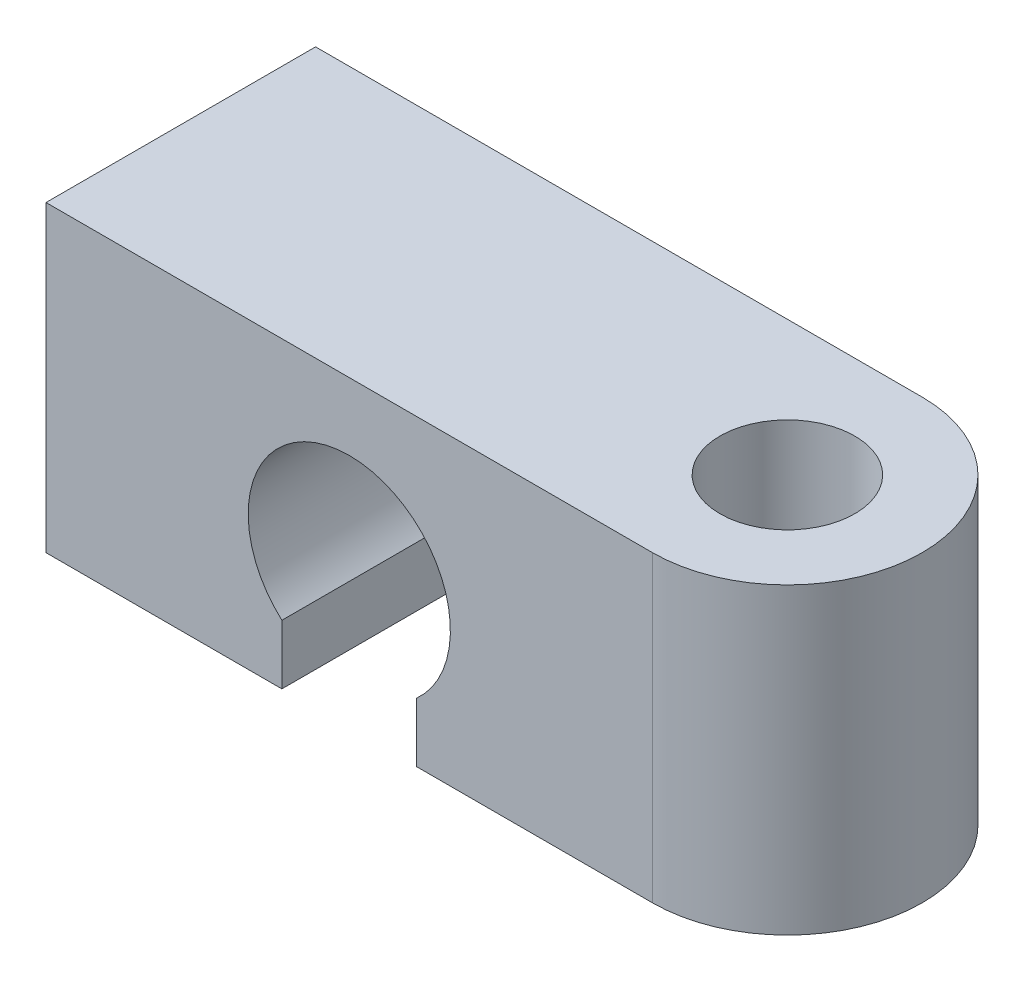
ISO-10303-21;
HEADER;
FILE_DESCRIPTION(('STEP AP214'),'2;1');
FILE_NAME('part.step','',(''),(''),'','','');
FILE_SCHEMA(('AUTOMOTIVE_DESIGN { 1 0 10303 214 1 1 1 1 }'));
ENDSEC;
DATA;
#1=APPLICATION_CONTEXT('core data for automotive mechanical design processes');
#2=APPLICATION_PROTOCOL_DEFINITION('international standard','automotive_design',2000,#1);
#3=PRODUCT_CONTEXT('',#1,'mechanical');
#4=PRODUCT('Part','Part','',(#3));
#5=PRODUCT_RELATED_PRODUCT_CATEGORY('part','',(#4));
#6=PRODUCT_DEFINITION_FORMATION('','',#4);
#7=PRODUCT_DEFINITION_CONTEXT('part definition',#1,'design');
#8=PRODUCT_DEFINITION('design','',#6,#7);
#9=PRODUCT_DEFINITION_SHAPE('','',#8);
#10=(LENGTH_UNIT() NAMED_UNIT(*) SI_UNIT(.MILLI.,.METRE.));
#11=(NAMED_UNIT(*) PLANE_ANGLE_UNIT() SI_UNIT($,.RADIAN.));
#12=(NAMED_UNIT(*) SI_UNIT($,.STERADIAN.) SOLID_ANGLE_UNIT());
#13=UNCERTAINTY_MEASURE_WITH_UNIT(LENGTH_MEASURE(1.E-05),#10,'distance_accuracy_value','');
#14=(GEOMETRIC_REPRESENTATION_CONTEXT(3) GLOBAL_UNCERTAINTY_ASSIGNED_CONTEXT((#13)) GLOBAL_UNIT_ASSIGNED_CONTEXT((#10,
#11,#12)) REPRESENTATION_CONTEXT('',''));
#15=CARTESIAN_POINT('',(0.,0.,0.));
#16=DIRECTION('',(0.,0.,1.));
#17=DIRECTION('',(1.,0.,0.));
#18=AXIS2_PLACEMENT_3D('',#15,#16,#17);
#19=CARTESIAN_POINT('',(-4.5,2.5,2.));
#20=DIRECTION('',(1.,0.,0.));
#21=DIRECTION('',(0.,1.,0.));
#22=AXIS2_PLACEMENT_3D('',#19,#20,#21);
#23=PLANE('',#22);
#24=DIRECTION('',(0.,-1.,0.));
#25=VECTOR('',#24,1.);
#26=CARTESIAN_POINT('',(-4.5,2.5,-2.));
#27=LINE('',#26,#25);
#28=CARTESIAN_POINT('',(-4.5,2.5,-2.));
#29=VERTEX_POINT('',#28);
#30=CARTESIAN_POINT('',(-4.5,-2.,-2.));
#31=VERTEX_POINT('',#30);
#32=EDGE_CURVE('E117',#29,#31,#27,.T.);
#33=ORIENTED_EDGE('',*,*,#32,.T.);
#34=DIRECTION('',(0.,0.,-1.));
#35=VECTOR('',#34,1.);
#36=CARTESIAN_POINT('',(-4.5,-2.,2.));
#37=LINE('',#36,#35);
#38=CARTESIAN_POINT('',(-4.5,-2.,2.));
#39=VERTEX_POINT('',#38);
#40=EDGE_CURVE('E11',#39,#31,#37,.T.);
#41=ORIENTED_EDGE('',*,*,#40,.F.);
#42=DIRECTION('',(0.,-1.,0.));
#43=VECTOR('',#42,1.);
#44=CARTESIAN_POINT('',(-4.5,2.5,2.));
#45=LINE('',#44,#43);
#46=CARTESIAN_POINT('',(-4.5,2.5,2.));
#47=VERTEX_POINT('',#46);
#48=EDGE_CURVE('E141',#47,#39,#45,.T.);
#49=ORIENTED_EDGE('',*,*,#48,.F.);
#50=DIRECTION('',(0.,0.,-1.));
#51=VECTOR('',#50,1.);
#52=CARTESIAN_POINT('',(-4.5,2.5,2.));
#53=LINE('',#52,#51);
#54=EDGE_CURVE('E123',#47,#29,#53,.T.);
#55=ORIENTED_EDGE('',*,*,#54,.T.);
#56=EDGE_LOOP('',(#33,#41,#49,#55));
#57=FACE_BOUND('',#56,.T.);
#58=ADVANCED_FACE('F32',(#57),#23,.F.);
#59=CARTESIAN_POINT('',(-4.5,-2.,2.));
#60=DIRECTION('',(0.,1.,0.));
#61=DIRECTION('',(0.,0.,1.));
#62=AXIS2_PLACEMENT_3D('',#59,#60,#61);
#63=PLANE('',#62);
#64=DIRECTION('',(1.,0.,0.));
#65=VECTOR('',#64,1.);
#66=CARTESIAN_POINT('',(-4.5,-2.,-2.));
#67=LINE('',#66,#65);
#68=CARTESIAN_POINT('',(-1.,-2.,-2.));
#69=VERTEX_POINT('',#68);
#70=EDGE_CURVE('E129',#31,#69,#67,.T.);
#71=ORIENTED_EDGE('',*,*,#70,.T.);
#72=DIRECTION('',(0.,0.,-1.));
#73=VECTOR('',#72,1.);
#74=CARTESIAN_POINT('',(-1.,-2.,2.));
#75=LINE('',#74,#73);
#76=CARTESIAN_POINT('',(-1.,-2.,2.));
#77=VERTEX_POINT('',#76);
#78=EDGE_CURVE('E40',#77,#69,#75,.T.);
#79=ORIENTED_EDGE('',*,*,#78,.F.);
#80=DIRECTION('',(1.,0.,0.));
#81=VECTOR('',#80,1.);
#82=CARTESIAN_POINT('',(-4.5,-2.,2.));
#83=LINE('',#82,#81);
#84=EDGE_CURVE('E90',#39,#77,#83,.T.);
#85=ORIENTED_EDGE('',*,*,#84,.F.);
#86=ORIENTED_EDGE('',*,*,#40,.T.);
#87=EDGE_LOOP('',(#71,#79,#85,#86));
#88=FACE_BOUND('',#87,.T.);
#89=ADVANCED_FACE('F196',(#88),#63,.F.);
#90=CARTESIAN_POINT('',(-1.,-1.11803398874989,2.));
#91=DIRECTION('',(-1.,0.,0.));
#92=DIRECTION('',(0.,0.,1.));
#93=AXIS2_PLACEMENT_3D('',#90,#91,#92);
#94=PLANE('',#93);
#95=DIRECTION('',(0.,1.,0.));
#96=VECTOR('',#95,1.);
#97=CARTESIAN_POINT('',(-1.,-1.11803398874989,-2.));
#98=LINE('',#97,#96);
#99=CARTESIAN_POINT('',(-1.,-1.11803398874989,-2.));
#100=VERTEX_POINT('',#99);
#101=EDGE_CURVE('E131',#69,#100,#98,.T.);
#102=ORIENTED_EDGE('',*,*,#101,.T.);
#103=DIRECTION('',(0.,0.,-1.));
#104=VECTOR('',#103,1.);
#105=CARTESIAN_POINT('',(-1.,-1.11803398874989,2.));
#106=LINE('',#105,#104);
#107=CARTESIAN_POINT('',(-1.,-1.11803398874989,2.));
#108=VERTEX_POINT('',#107);
#109=EDGE_CURVE('E148',#108,#100,#106,.T.);
#110=ORIENTED_EDGE('',*,*,#109,.F.);
#111=DIRECTION('',(0.,1.,0.));
#112=VECTOR('',#111,1.);
#113=CARTESIAN_POINT('',(-1.,-1.11803398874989,2.));
#114=LINE('',#113,#112);
#115=EDGE_CURVE('E156',#77,#108,#114,.T.);
#116=ORIENTED_EDGE('',*,*,#115,.F.);
#117=ORIENTED_EDGE('',*,*,#78,.T.);
#118=EDGE_LOOP('',(#102,#110,#116,#117));
#119=FACE_BOUND('',#118,.T.);
#120=ADVANCED_FACE('F154',(#119),#94,.F.);
#121=CARTESIAN_POINT('',(0.,0.,2.));
#122=DIRECTION('',(0.,0.,-1.));
#123=DIRECTION('',(-1.,0.,0.));
#124=AXIS2_PLACEMENT_3D('',#121,#122,#123);
#125=CYLINDRICAL_SURFACE('',#124,1.5);
#126=CARTESIAN_POINT('',(0.,0.,-2.));
#127=DIRECTION('',(0.,0.,-1.));
#128=DIRECTION('',(1.,0.,0.));
#129=AXIS2_PLACEMENT_3D('',#126,#127,#128);
#130=CIRCLE('',#129,1.5);
#131=CARTESIAN_POINT('',(1.,-1.11803398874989,-2.));
#132=VERTEX_POINT('',#131);
#133=EDGE_CURVE('E133',#100,#132,#130,.T.);
#134=ORIENTED_EDGE('',*,*,#133,.T.);
#135=DIRECTION('',(0.,0.,-1.));
#136=VECTOR('',#135,1.);
#137=CARTESIAN_POINT('',(1.,-1.11803398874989,2.));
#138=LINE('',#137,#136);
#139=CARTESIAN_POINT('',(1.,-1.11803398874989,2.));
#140=VERTEX_POINT('',#139);
#141=EDGE_CURVE('E145',#140,#132,#138,.T.);
#142=ORIENTED_EDGE('',*,*,#141,.F.);
#143=CARTESIAN_POINT('',(0.,0.,2.));
#144=DIRECTION('',(0.,0.,-1.));
#145=DIRECTION('',(1.,0.,0.));
#146=AXIS2_PLACEMENT_3D('',#143,#144,#145);
#147=CIRCLE('',#146,1.5);
#148=EDGE_CURVE('E168',#108,#140,#147,.T.);
#149=ORIENTED_EDGE('',*,*,#148,.F.);
#150=ORIENTED_EDGE('',*,*,#109,.T.);
#151=EDGE_LOOP('',(#134,#142,#149,#150));
#152=FACE_BOUND('',#151,.T.);
#153=ADVANCED_FACE('F164',(#152),#125,.F.);
#154=CARTESIAN_POINT('',(1.,-1.11803398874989,2.));
#155=DIRECTION('',(1.,0.,0.));
#156=DIRECTION('',(0.,0.,-1.));
#157=AXIS2_PLACEMENT_3D('',#154,#155,#156);
#158=PLANE('',#157);
#159=DIRECTION('',(0.,-1.,0.));
#160=VECTOR('',#159,1.);
#161=CARTESIAN_POINT('',(1.,-1.11803398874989,-2.));
#162=LINE('',#161,#160);
#163=CARTESIAN_POINT('',(1.,-2.,-2.));
#164=VERTEX_POINT('',#163);
#165=EDGE_CURVE('E135',#132,#164,#162,.T.);
#166=ORIENTED_EDGE('',*,*,#165,.T.);
#167=DIRECTION('',(0.,0.,-1.));
#168=VECTOR('',#167,1.);
#169=CARTESIAN_POINT('',(1.,-2.,2.));
#170=LINE('',#169,#168);
#171=CARTESIAN_POINT('',(1.,-2.,2.));
#172=VERTEX_POINT('',#171);
#173=EDGE_CURVE('E143',#172,#164,#170,.T.);
#174=ORIENTED_EDGE('',*,*,#173,.F.);
#175=DIRECTION('',(0.,-1.,0.));
#176=VECTOR('',#175,1.);
#177=CARTESIAN_POINT('',(1.,-1.11803398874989,2.));
#178=LINE('',#177,#176);
#179=EDGE_CURVE('E109',#140,#172,#178,.T.);
#180=ORIENTED_EDGE('',*,*,#179,.F.);
#181=ORIENTED_EDGE('',*,*,#141,.T.);
#182=EDGE_LOOP('',(#166,#174,#180,#181));
#183=FACE_BOUND('',#182,.T.);
#184=ADVANCED_FACE('F167',(#183),#158,.F.);
#185=CARTESIAN_POINT('',(1.,-2.,2.));
#186=DIRECTION('',(0.,1.,0.));
#187=DIRECTION('',(0.,0.,1.));
#188=AXIS2_PLACEMENT_3D('',#185,#186,#187);
#189=PLANE('',#188);
#190=CARTESIAN_POINT('',(4.5,-2.,0.));
#191=DIRECTION('',(0.,1.,0.));
#192=DIRECTION('',(0.,0.,1.));
#193=AXIS2_PLACEMENT_3D('',#190,#191,#192);
#194=CIRCLE('',#193,0.999999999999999);
#195=CARTESIAN_POINT('',(4.5,-2.,0.999999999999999));
#196=VERTEX_POINT('',#195);
#197=EDGE_CURVE('E174',#196,#196,#194,.T.);
#198=ORIENTED_EDGE('',*,*,#197,.T.);
#199=EDGE_LOOP('',(#198));
#200=FACE_BOUND('',#199,.T.);
#201=DIRECTION('',(1.,0.,0.));
#202=VECTOR('',#201,1.);
#203=CARTESIAN_POINT('',(1.,-2.,-2.));
#204=LINE('',#203,#202);
#205=CARTESIAN_POINT('',(4.5,-2.,-2.));
#206=VERTEX_POINT('',#205);
#207=EDGE_CURVE('E75',#164,#206,#204,.T.);
#208=ORIENTED_EDGE('',*,*,#207,.T.);
#209=CARTESIAN_POINT('',(4.5,-2.,0.));
#210=DIRECTION('',(0.,1.,0.));
#211=DIRECTION('',(0.,0.,1.));
#212=AXIS2_PLACEMENT_3D('',#209,#210,#211);
#213=CIRCLE('',#212,2.);
#214=CARTESIAN_POINT('',(4.5,-2.,2.));
#215=VERTEX_POINT('',#214);
#216=EDGE_CURVE('E113',#206,#215,#213,.F.);
#217=ORIENTED_EDGE('',*,*,#216,.T.);
#218=DIRECTION('',(1.,0.,0.));
#219=VECTOR('',#218,1.);
#220=CARTESIAN_POINT('',(1.,-2.,2.));
#221=LINE('',#220,#219);
#222=EDGE_CURVE('E104',#172,#215,#221,.T.);
#223=ORIENTED_EDGE('',*,*,#222,.F.);
#224=ORIENTED_EDGE('',*,*,#173,.T.);
#225=EDGE_LOOP('',(#208,#217,#223,#224));
#226=FACE_BOUND('',#225,.T.);
#227=ADVANCED_FACE('F114',(#200,#226),#189,.F.);
#228=CARTESIAN_POINT('',(-4.5,2.5,2.));
#229=DIRECTION('',(0.,-1.,0.));
#230=DIRECTION('',(0.,0.,-1.));
#231=AXIS2_PLACEMENT_3D('',#228,#229,#230);
#232=PLANE('',#231);
#233=CARTESIAN_POINT('',(4.5,2.5,0.));
#234=DIRECTION('',(0.,1.,0.));
#235=DIRECTION('',(0.,0.,1.));
#236=AXIS2_PLACEMENT_3D('',#233,#234,#235);
#237=CIRCLE('',#236,0.999999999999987);
#238=CARTESIAN_POINT('',(4.5,2.5,0.999999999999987));
#239=VERTEX_POINT('',#238);
#240=EDGE_CURVE('E178',#239,#239,#237,.T.);
#241=ORIENTED_EDGE('',*,*,#240,.F.);
#242=EDGE_LOOP('',(#241));
#243=FACE_BOUND('',#242,.T.);
#244=DIRECTION('',(-1.,0.,0.));
#245=VECTOR('',#244,1.);
#246=CARTESIAN_POINT('',(-4.5,2.5,-2.));
#247=LINE('',#246,#245);
#248=CARTESIAN_POINT('',(4.5,2.5,-2.));
#249=VERTEX_POINT('',#248);
#250=EDGE_CURVE('E82',#249,#29,#247,.T.);
#251=ORIENTED_EDGE('',*,*,#250,.T.);
#252=ORIENTED_EDGE('',*,*,#54,.F.);
#253=DIRECTION('',(-1.,0.,0.));
#254=VECTOR('',#253,1.);
#255=CARTESIAN_POINT('',(-4.5,2.5,2.));
#256=LINE('',#255,#254);
#257=CARTESIAN_POINT('',(4.5,2.5,2.));
#258=VERTEX_POINT('',#257);
#259=EDGE_CURVE('E48',#258,#47,#256,.T.);
#260=ORIENTED_EDGE('',*,*,#259,.F.);
#261=CARTESIAN_POINT('',(4.5,2.5,0.));
#262=DIRECTION('',(0.,1.,0.));
#263=DIRECTION('',(0.,0.,1.));
#264=AXIS2_PLACEMENT_3D('',#261,#262,#263);
#265=CIRCLE('',#264,2.);
#266=EDGE_CURVE('E118',#258,#249,#265,.T.);
#267=ORIENTED_EDGE('',*,*,#266,.T.);
#268=EDGE_LOOP('',(#251,#252,#260,#267));
#269=FACE_BOUND('',#268,.T.);
#270=ADVANCED_FACE('F184',(#243,#269),#232,.F.);
#271=CARTESIAN_POINT('',(0.,0.,2.));
#272=DIRECTION('',(0.,0.,1.));
#273=DIRECTION('',(1.,0.,0.));
#274=AXIS2_PLACEMENT_3D('',#271,#272,#273);
#275=PLANE('',#274);
#276=ORIENTED_EDGE('',*,*,#48,.T.);
#277=ORIENTED_EDGE('',*,*,#84,.T.);
#278=ORIENTED_EDGE('',*,*,#115,.T.);
#279=ORIENTED_EDGE('',*,*,#148,.T.);
#280=ORIENTED_EDGE('',*,*,#179,.T.);
#281=ORIENTED_EDGE('',*,*,#222,.T.);
#282=DIRECTION('',(0.,1.,0.));
#283=VECTOR('',#282,1.);
#284=CARTESIAN_POINT('',(4.5,2.5,2.));
#285=LINE('',#284,#283);
#286=EDGE_CURVE('E107',#215,#258,#285,.T.);
#287=ORIENTED_EDGE('',*,*,#286,.T.);
#288=ORIENTED_EDGE('',*,*,#259,.T.);
#289=EDGE_LOOP('',(#276,#277,#278,#279,#280,#281,#287,#288));
#290=FACE_BOUND('',#289,.T.);
#291=ADVANCED_FACE('F105',(#290),#275,.T.);
#292=CARTESIAN_POINT('',(0.,0.,-2.));
#293=DIRECTION('',(0.,0.,1.));
#294=DIRECTION('',(1.,0.,0.));
#295=AXIS2_PLACEMENT_3D('',#292,#293,#294);
#296=PLANE('',#295);
#297=ORIENTED_EDGE('',*,*,#32,.F.);
#298=ORIENTED_EDGE('',*,*,#250,.F.);
#299=DIRECTION('',(0.,1.,0.));
#300=VECTOR('',#299,1.);
#301=CARTESIAN_POINT('',(4.5,2.5,-2.));
#302=LINE('',#301,#300);
#303=EDGE_CURVE('E138',#206,#249,#302,.T.);
#304=ORIENTED_EDGE('',*,*,#303,.F.);
#305=ORIENTED_EDGE('',*,*,#207,.F.);
#306=ORIENTED_EDGE('',*,*,#165,.F.);
#307=ORIENTED_EDGE('',*,*,#133,.F.);
#308=ORIENTED_EDGE('',*,*,#101,.F.);
#309=ORIENTED_EDGE('',*,*,#70,.F.);
#310=EDGE_LOOP('',(#297,#298,#304,#305,#306,#307,#308,#309));
#311=FACE_BOUND('',#310,.T.);
#312=ADVANCED_FACE('F160',(#311),#296,.F.);
#313=CARTESIAN_POINT('',(4.5,-6.47213595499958,0.));
#314=DIRECTION('',(0.,1.,0.));
#315=DIRECTION('',(0.,0.,1.));
#316=AXIS2_PLACEMENT_3D('',#313,#314,#315);
#317=CYLINDRICAL_SURFACE('',#316,2.);
#318=ORIENTED_EDGE('',*,*,#216,.F.);
#319=ORIENTED_EDGE('',*,*,#303,.T.);
#320=ORIENTED_EDGE('',*,*,#266,.F.);
#321=ORIENTED_EDGE('',*,*,#286,.F.);
#322=EDGE_LOOP('',(#318,#319,#320,#321));
#323=FACE_BOUND('',#322,.T.);
#324=ADVANCED_FACE('F121',(#323),#317,.T.);
#325=CARTESIAN_POINT('',(4.5,2.5,0.));
#326=DIRECTION('',(0.,1.,0.));
#327=DIRECTION('',(0.,0.,1.));
#328=AXIS2_PLACEMENT_3D('',#325,#326,#327);
#329=CYLINDRICAL_SURFACE('',#328,0.999999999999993);
#330=ORIENTED_EDGE('',*,*,#197,.F.);
#331=EDGE_LOOP('',(#330));
#332=FACE_BOUND('',#331,.T.);
#333=ORIENTED_EDGE('',*,*,#240,.T.);
#334=EDGE_LOOP('',(#333));
#335=FACE_BOUND('',#334,.T.);
#336=ADVANCED_FACE('F182',(#332,#335),#329,.F.);
#337=CLOSED_SHELL('',(#58,#89,#120,#153,#184,#227,#270,#291,#312,#324,#336));
#338=MANIFOLD_SOLID_BREP('B2',#337);
#339=ADVANCED_BREP_SHAPE_REPRESENTATION('',(#18,#338),#14);
#340=SHAPE_DEFINITION_REPRESENTATION(#9,#339);
ENDSEC;
END-ISO-10303-21;
